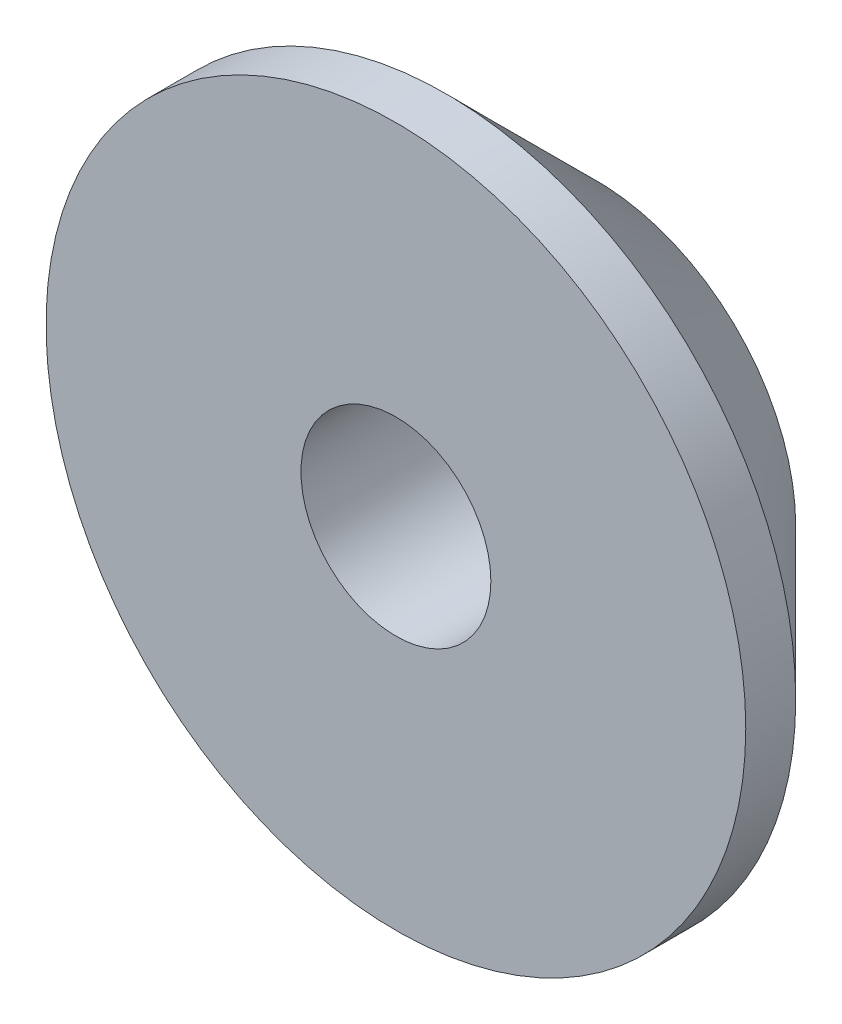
from build123d import *

# Parameters (mm, degrees)
ESQUISSE1_R      = 3.5
ESQUISSE1_R_2    = 0.95
EXTRUSION1_DEPTH = 2
CHANFREIN1_SIZE  = 1.5


with BuildPart() as part:
    # Esquisse1 → Extrusion1 (new body)
    with BuildSketch(Plane.XY):
        Circle(ESQUISSE1_R)
        Circle(ESQUISSE1_R_2, mode=Mode.SUBTRACT)
    extrude(amount=EXTRUSION1_DEPTH)

    # Chanfrein1
    chanfrein1_edges = [part.edges().sort_by_distance(p)[0] for p in [
        (-3.5, 0, 0),
    ]]
    chamfer(chanfrein1_edges, length=CHANFREIN1_SIZE)


solid = part.part
